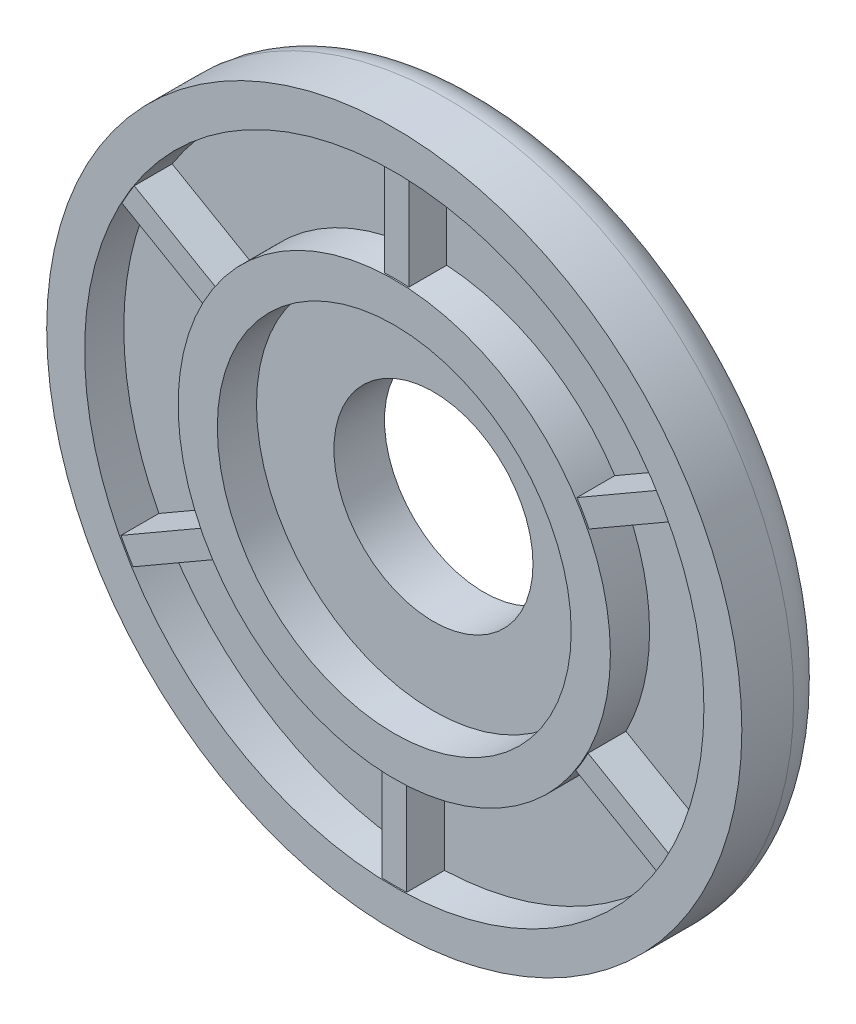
ISO-10303-21;
HEADER;
FILE_DESCRIPTION(('STEP AP214'),'2;1');
FILE_NAME('part.step','',(''),(''),'','','');
FILE_SCHEMA(('AUTOMOTIVE_DESIGN { 1 0 10303 214 1 1 1 1 }'));
ENDSEC;
DATA;
#1=APPLICATION_CONTEXT('core data for automotive mechanical design processes');
#2=APPLICATION_PROTOCOL_DEFINITION('international standard','automotive_design',2000,#1);
#3=PRODUCT_CONTEXT('',#1,'mechanical');
#4=PRODUCT('Part','Part','',(#3));
#5=PRODUCT_RELATED_PRODUCT_CATEGORY('part','',(#4));
#6=PRODUCT_DEFINITION_FORMATION('','',#4);
#7=PRODUCT_DEFINITION_CONTEXT('part definition',#1,'design');
#8=PRODUCT_DEFINITION('design','',#6,#7);
#9=PRODUCT_DEFINITION_SHAPE('','',#8);
#10=(LENGTH_UNIT() NAMED_UNIT(*) SI_UNIT(.MILLI.,.METRE.));
#11=(NAMED_UNIT(*) PLANE_ANGLE_UNIT() SI_UNIT($,.RADIAN.));
#12=(NAMED_UNIT(*) SI_UNIT($,.STERADIAN.) SOLID_ANGLE_UNIT());
#13=UNCERTAINTY_MEASURE_WITH_UNIT(LENGTH_MEASURE(1.E-05),#10,'distance_accuracy_value','');
#14=(GEOMETRIC_REPRESENTATION_CONTEXT(3) GLOBAL_UNCERTAINTY_ASSIGNED_CONTEXT((#13)) GLOBAL_UNIT_ASSIGNED_CONTEXT((#10,
#11,#12)) REPRESENTATION_CONTEXT('',''));
#15=CARTESIAN_POINT('',(0.,0.,0.));
#16=DIRECTION('',(0.,0.,1.));
#17=DIRECTION('',(1.,0.,0.));
#18=AXIS2_PLACEMENT_3D('',#15,#16,#17);
#19=CARTESIAN_POINT('',(0.,0.,4.));
#20=DIRECTION('',(0.,0.,1.));
#21=DIRECTION('',(1.,0.,0.));
#22=AXIS2_PLACEMENT_3D('',#19,#20,#21);
#23=PLANE('',#22);
#24=CARTESIAN_POINT('',(0.,0.,4.));
#25=DIRECTION('',(0.,0.,1.));
#26=DIRECTION('',(1.,0.,0.));
#27=AXIS2_PLACEMENT_3D('',#24,#25,#26);
#28=CIRCLE('',#27,17.1);
#29=CARTESIAN_POINT('',(-15.2287475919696,7.77786903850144,4.));
#30=VERTEX_POINT('',#29);
#31=CARTESIAN_POINT('',(-15.3067415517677,-7.62323179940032,4.));
#32=VERTEX_POINT('',#31);
#33=EDGE_CURVE('E436',#30,#32,#28,.T.);
#34=ORIENTED_EDGE('',*,*,#33,.F.);
#35=DIRECTION('',(0.866025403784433,-0.50000000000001,0.));
#36=VECTOR('',#35,1.);
#37=CARTESIAN_POINT('',(-22.0298769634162,11.7045029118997,4.));
#38=LINE('',#37,#36);
#39=CARTESIAN_POINT('',(-21.6432474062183,11.4812822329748,4.));
#40=VERTEX_POINT('',#39);
#41=EDGE_CURVE('E258',#40,#30,#38,.T.);
#42=ORIENTED_EDGE('',*,*,#41,.F.);
#43=CARTESIAN_POINT('',(0.,0.,4.));
#44=DIRECTION('',(0.,0.,1.));
#45=DIRECTION('',(1.,0.,0.));
#46=AXIS2_PLACEMENT_3D('',#43,#44,#45);
#47=CIRCLE('',#46,24.5);
#48=CARTESIAN_POINT('',(-21.7238028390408,-11.3281238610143,4.));
#49=VERTEX_POINT('',#48);
#50=EDGE_CURVE('E432',#40,#49,#47,.T.);
#51=ORIENTED_EDGE('',*,*,#50,.T.);
#52=DIRECTION('',(-0.866025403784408,-0.500000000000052,0.));
#53=VECTOR('',#52,1.);
#54=CARTESIAN_POINT('',(-14.9497706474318,-7.41713455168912,4.));
#55=LINE('',#54,#53);
#56=EDGE_CURVE('E268',#32,#49,#55,.T.);
#57=ORIENTED_EDGE('',*,*,#56,.F.);
#58=EDGE_LOOP('',(#34,#42,#51,#57));
#59=FACE_BOUND('',#58,.T.);
#60=ADVANCED_FACE('F63',(#59),#23,.T.);
#61=CARTESIAN_POINT('',(-0.878541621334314,24.4842431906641,4.));
#62=VERTEX_POINT('',#61);
#63=CARTESIAN_POINT('',(-20.6723444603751,13.1493031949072,4.));
#64=VERTEX_POINT('',#63);
#65=EDGE_CURVE('E428',#62,#64,#47,.T.);
#66=ORIENTED_EDGE('',*,*,#65,.T.);
#67=DIRECTION('',(-0.866025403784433,0.50000000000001,0.));
#68=VECTOR('',#67,1.);
#69=CARTESIAN_POINT('',(-13.898312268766,9.23831388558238,4.));
#70=LINE('',#69,#68);
#71=CARTESIAN_POINT('',(-14.2552831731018,9.44441113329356,4.));
#72=VERTEX_POINT('',#71);
#73=EDGE_CURVE('E255',#72,#64,#70,.T.);
#74=ORIENTED_EDGE('',*,*,#73,.F.);
#75=CARTESIAN_POINT('',(-0.878541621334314,17.0774168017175,4.));
#76=VERTEX_POINT('',#75);
#77=EDGE_CURVE('E230',#76,#72,#28,.T.);
#78=ORIENTED_EDGE('',*,*,#77,.F.);
#79=DIRECTION('',(0.,-1.,0.));
#80=VECTOR('',#79,1.);
#81=CARTESIAN_POINT('',(-0.878541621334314,24.9306845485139,4.));
#82=LINE('',#81,#80);
#83=EDGE_CURVE('E375',#62,#76,#82,.T.);
#84=ORIENTED_EDGE('',*,*,#83,.F.);
#85=EDGE_LOOP('',(#66,#74,#78,#84));
#86=FACE_BOUND('',#85,.T.);
#87=ADVANCED_FACE('F504',(#86),#23,.T.);
#88=CARTESIAN_POINT('',(0.,0.,0.9));
#89=DIRECTION('',(0.,0.,1.));
#90=DIRECTION('',(1.,0.,0.));
#91=AXIS2_PLACEMENT_3D('',#88,#89,#90);
#92=CYLINDRICAL_SURFACE('',#91,24.5);
#93=CARTESIAN_POINT('',(0.,0.,7.1));
#94=DIRECTION('',(0.,0.,1.));
#95=DIRECTION('',(1.,0.,0.));
#96=AXIS2_PLACEMENT_3D('',#93,#94,#95);
#97=CIRCLE('',#96,24.5);
#98=CARTESIAN_POINT('',(24.5,0.,7.1));
#99=VERTEX_POINT('',#98);
#100=EDGE_CURVE('E410',#99,#99,#97,.T.);
#101=ORIENTED_EDGE('',*,*,#100,.T.);
#102=EDGE_LOOP('',(#101));
#103=FACE_BOUND('',#102,.T.);
#104=DIRECTION('',(0.,0.,1.));
#105=VECTOR('',#104,1.);
#106=CARTESIAN_POINT('',(-21.6432474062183,11.4812822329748,0.9));
#107=LINE('',#106,#105);
#108=CARTESIAN_POINT('',(-21.6432474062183,11.4812822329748,7.));
#109=VERTEX_POINT('',#108);
#110=EDGE_CURVE('E84',#109,#40,#107,.F.);
#111=ORIENTED_EDGE('',*,*,#110,.F.);
#112=CARTESIAN_POINT('',(0.,0.,7.));
#113=DIRECTION('',(0.,0.,1.));
#114=DIRECTION('',(1.,0.,0.));
#115=AXIS2_PLACEMENT_3D('',#112,#113,#114);
#116=CIRCLE('',#115,24.5);
#117=CARTESIAN_POINT('',(-20.6723444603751,13.1493031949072,7.));
#118=VERTEX_POINT('',#117);
#119=EDGE_CURVE('E79',#109,#118,#116,.F.);
#120=ORIENTED_EDGE('',*,*,#119,.T.);
#121=DIRECTION('',(0.,0.,1.));
#122=VECTOR('',#121,1.);
#123=CARTESIAN_POINT('',(-20.6723444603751,13.1493031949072,0.9));
#124=LINE('',#123,#122);
#125=EDGE_CURVE('E248',#64,#118,#124,.T.);
#126=ORIENTED_EDGE('',*,*,#125,.F.);
#127=ORIENTED_EDGE('',*,*,#65,.F.);
#128=DIRECTION('',(0.,0.,1.));
#129=VECTOR('',#128,1.);
#130=CARTESIAN_POINT('',(-0.878541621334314,24.4842431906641,0.9));
#131=LINE('',#130,#129);
#132=CARTESIAN_POINT('',(-0.878541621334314,24.4842431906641,7.));
#133=VERTEX_POINT('',#132);
#134=EDGE_CURVE('E398',#133,#62,#131,.F.);
#135=ORIENTED_EDGE('',*,*,#134,.F.);
#136=CARTESIAN_POINT('',(0.,0.,7.));
#137=DIRECTION('',(0.,0.,1.));
#138=DIRECTION('',(1.,0.,0.));
#139=AXIS2_PLACEMENT_3D('',#136,#137,#138);
#140=CIRCLE('',#139,24.5);
#141=CARTESIAN_POINT('',(1.05145837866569,24.477427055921,7.));
#142=VERTEX_POINT('',#141);
#143=EDGE_CURVE('E385',#133,#142,#140,.F.);
#144=ORIENTED_EDGE('',*,*,#143,.T.);
#145=DIRECTION('',(0.,0.,1.));
#146=VECTOR('',#145,1.);
#147=CARTESIAN_POINT('',(1.05145837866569,24.477427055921,0.9));
#148=LINE('',#147,#146);
#149=CARTESIAN_POINT('',(1.05145837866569,24.477427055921,4.));
#150=VERTEX_POINT('',#149);
#151=EDGE_CURVE('E394',#150,#142,#148,.T.);
#152=ORIENTED_EDGE('',*,*,#151,.F.);
#153=CARTESIAN_POINT('',(20.7647057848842,13.0029609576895,4.));
#154=VERTEX_POINT('',#153);
#155=EDGE_CURVE('E418',#154,#150,#47,.T.);
#156=ORIENTED_EDGE('',*,*,#155,.F.);
#157=DIRECTION('',(0.,0.,1.));
#158=VECTOR('',#157,1.);
#159=CARTESIAN_POINT('',(20.7647057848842,13.0029609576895,0.9));
#160=LINE('',#159,#158);
#161=CARTESIAN_POINT('',(20.7647057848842,13.0029609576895,7.));
#162=VERTEX_POINT('',#161);
#163=EDGE_CURVE('E371',#162,#154,#160,.F.);
#164=ORIENTED_EDGE('',*,*,#163,.F.);
#165=CARTESIAN_POINT('',(0.,0.,7.));
#166=DIRECTION('',(0.,0.,1.));
#167=DIRECTION('',(1.,0.,0.));
#168=AXIS2_PLACEMENT_3D('',#165,#166,#167);
#169=CIRCLE('',#168,24.5);
#170=CARTESIAN_POINT('',(21.723802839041,11.328123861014,7.));
#171=VERTEX_POINT('',#170);
#172=EDGE_CURVE('E358',#162,#171,#169,.F.);
#173=ORIENTED_EDGE('',*,*,#172,.T.);
#174=DIRECTION('',(0.,0.,1.));
#175=VECTOR('',#174,1.);
#176=CARTESIAN_POINT('',(21.723802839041,11.328123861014,0.9));
#177=LINE('',#176,#175);
#178=CARTESIAN_POINT('',(21.723802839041,11.328123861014,4.));
#179=VERTEX_POINT('',#178);
#180=EDGE_CURVE('E367',#179,#171,#177,.T.);
#181=ORIENTED_EDGE('',*,*,#180,.F.);
#182=CARTESIAN_POINT('',(21.6432474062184,-11.4812822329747,4.));
#183=VERTEX_POINT('',#182);
#184=EDGE_CURVE('E548',#183,#179,#47,.T.);
#185=ORIENTED_EDGE('',*,*,#184,.F.);
#186=DIRECTION('',(0.,0.,1.));
#187=VECTOR('',#186,1.);
#188=CARTESIAN_POINT('',(21.6432474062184,-11.4812822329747,0.9));
#189=LINE('',#188,#187);
#190=CARTESIAN_POINT('',(21.6432474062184,-11.4812822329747,7.));
#191=VERTEX_POINT('',#190);
#192=EDGE_CURVE('E344',#191,#183,#189,.F.);
#193=ORIENTED_EDGE('',*,*,#192,.F.);
#194=CARTESIAN_POINT('',(0.,0.,7.));
#195=DIRECTION('',(0.,0.,1.));
#196=DIRECTION('',(1.,0.,0.));
#197=AXIS2_PLACEMENT_3D('',#194,#195,#196);
#198=CIRCLE('',#197,24.5);
#199=CARTESIAN_POINT('',(20.6723444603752,-13.1493031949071,7.));
#200=VERTEX_POINT('',#199);
#201=EDGE_CURVE('E331',#191,#200,#198,.F.);
#202=ORIENTED_EDGE('',*,*,#201,.T.);
#203=DIRECTION('',(0.,0.,1.));
#204=VECTOR('',#203,1.);
#205=CARTESIAN_POINT('',(20.6723444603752,-13.1493031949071,0.9));
#206=LINE('',#205,#204);
#207=CARTESIAN_POINT('',(20.6723444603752,-13.1493031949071,4.));
#208=VERTEX_POINT('',#207);
#209=EDGE_CURVE('E340',#208,#200,#206,.T.);
#210=ORIENTED_EDGE('',*,*,#209,.F.);
#211=CARTESIAN_POINT('',(0.878541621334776,-24.4842431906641,4.));
#212=VERTEX_POINT('',#211);
#213=EDGE_CURVE('E551',#212,#208,#47,.T.);
#214=ORIENTED_EDGE('',*,*,#213,.F.);
#215=DIRECTION('',(0.,0.,1.));
#216=VECTOR('',#215,1.);
#217=CARTESIAN_POINT('',(0.878541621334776,-24.4842431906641,0.9));
#218=LINE('',#217,#216);
#219=CARTESIAN_POINT('',(0.878541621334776,-24.4842431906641,7.));
#220=VERTEX_POINT('',#219);
#221=EDGE_CURVE('E317',#220,#212,#218,.F.);
#222=ORIENTED_EDGE('',*,*,#221,.F.);
#223=CARTESIAN_POINT('',(0.,0.,7.));
#224=DIRECTION('',(0.,0.,1.));
#225=DIRECTION('',(1.,0.,0.));
#226=AXIS2_PLACEMENT_3D('',#223,#224,#225);
#227=CIRCLE('',#226,24.5);
#228=CARTESIAN_POINT('',(-1.05145837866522,-24.477427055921,7.));
#229=VERTEX_POINT('',#228);
#230=EDGE_CURVE('E304',#220,#229,#227,.F.);
#231=ORIENTED_EDGE('',*,*,#230,.T.);
#232=DIRECTION('',(0.,0.,1.));
#233=VECTOR('',#232,1.);
#234=CARTESIAN_POINT('',(-1.05145837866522,-24.477427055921,0.9));
#235=LINE('',#234,#233);
#236=CARTESIAN_POINT('',(-1.05145837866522,-24.477427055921,4.));
#237=VERTEX_POINT('',#236);
#238=EDGE_CURVE('E313',#237,#229,#235,.T.);
#239=ORIENTED_EDGE('',*,*,#238,.F.);
#240=CARTESIAN_POINT('',(-20.764705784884,-13.0029609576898,4.));
#241=VERTEX_POINT('',#240);
#242=EDGE_CURVE('E569',#241,#237,#47,.T.);
#243=ORIENTED_EDGE('',*,*,#242,.F.);
#244=DIRECTION('',(0.,0.,1.));
#245=VECTOR('',#244,1.);
#246=CARTESIAN_POINT('',(-20.764705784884,-13.0029609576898,0.9));
#247=LINE('',#246,#245);
#248=CARTESIAN_POINT('',(-20.764705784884,-13.0029609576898,7.));
#249=VERTEX_POINT('',#248);
#250=EDGE_CURVE('E290',#249,#241,#247,.F.);
#251=ORIENTED_EDGE('',*,*,#250,.F.);
#252=CARTESIAN_POINT('',(0.,0.,7.));
#253=DIRECTION('',(0.,0.,1.));
#254=DIRECTION('',(1.,0.,0.));
#255=AXIS2_PLACEMENT_3D('',#252,#253,#254);
#256=CIRCLE('',#255,24.5);
#257=CARTESIAN_POINT('',(-21.7238028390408,-11.3281238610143,7.));
#258=VERTEX_POINT('',#257);
#259=EDGE_CURVE('E277',#249,#258,#256,.F.);
#260=ORIENTED_EDGE('',*,*,#259,.T.);
#261=DIRECTION('',(0.,0.,1.));
#262=VECTOR('',#261,1.);
#263=CARTESIAN_POINT('',(-21.7238028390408,-11.3281238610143,0.9));
#264=LINE('',#263,#262);
#265=EDGE_CURVE('E286',#49,#258,#264,.T.);
#266=ORIENTED_EDGE('',*,*,#265,.F.);
#267=ORIENTED_EDGE('',*,*,#50,.F.);
#268=EDGE_LOOP('',(#111,#120,#126,#127,#135,#144,#152,#156,#164,#173,#181,#185,#193,#202,#210,
#214,#222,#231,#239,#243,#251,#260,#266,#267));
#269=FACE_BOUND('',#268,.T.);
#270=ADVANCED_FACE('F510',(#103,#269),#92,.F.);
#271=CARTESIAN_POINT('',(0.,0.,0.9));
#272=DIRECTION('',(0.,0.,1.));
#273=DIRECTION('',(1.,0.,0.));
#274=AXIS2_PLACEMENT_3D('',#271,#272,#273);
#275=CYLINDRICAL_SURFACE('',#274,17.1);
#276=CARTESIAN_POINT('',(0.,0.,7.1));
#277=DIRECTION('',(0.,0.,1.));
#278=DIRECTION('',(1.,0.,0.));
#279=AXIS2_PLACEMENT_3D('',#276,#277,#278);
#280=CIRCLE('',#279,17.1);
#281=CARTESIAN_POINT('',(17.1,0.,7.1));
#282=VERTEX_POINT('',#281);
#283=EDGE_CURVE('E405',#282,#282,#280,.T.);
#284=ORIENTED_EDGE('',*,*,#283,.F.);
#285=EDGE_LOOP('',(#284));
#286=FACE_BOUND('',#285,.T.);
#287=CARTESIAN_POINT('',(0.,0.,7.));
#288=DIRECTION('',(0.,0.,1.));
#289=DIRECTION('',(1.,0.,0.));
#290=AXIS2_PLACEMENT_3D('',#287,#288,#289);
#291=CIRCLE('',#290,17.1);
#292=CARTESIAN_POINT('',(-15.2287475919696,7.77786903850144,7.));
#293=VERTEX_POINT('',#292);
#294=CARTESIAN_POINT('',(-14.2552831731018,9.44441113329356,7.));
#295=VERTEX_POINT('',#294);
#296=EDGE_CURVE('E227',#293,#295,#291,.F.);
#297=ORIENTED_EDGE('',*,*,#296,.F.);
#298=DIRECTION('',(0.,0.,1.));
#299=VECTOR('',#298,1.);
#300=CARTESIAN_POINT('',(-15.2287475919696,7.77786903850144,0.9));
#301=LINE('',#300,#299);
#302=EDGE_CURVE('E235',#293,#30,#301,.F.);
#303=ORIENTED_EDGE('',*,*,#302,.T.);
#304=ORIENTED_EDGE('',*,*,#33,.T.);
#305=DIRECTION('',(0.,0.,1.));
#306=VECTOR('',#305,1.);
#307=CARTESIAN_POINT('',(-15.3067415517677,-7.62323179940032,0.9));
#308=LINE('',#307,#306);
#309=CARTESIAN_POINT('',(-15.3067415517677,-7.62323179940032,7.));
#310=VERTEX_POINT('',#309);
#311=EDGE_CURVE('E483',#32,#310,#308,.T.);
#312=ORIENTED_EDGE('',*,*,#311,.T.);
#313=CARTESIAN_POINT('',(0.,0.,7.));
#314=DIRECTION('',(0.,0.,1.));
#315=DIRECTION('',(1.,0.,0.));
#316=AXIS2_PLACEMENT_3D('',#313,#314,#315);
#317=CIRCLE('',#316,17.1);
#318=CARTESIAN_POINT('',(-14.3502059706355,-9.29954776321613,7.));
#319=VERTEX_POINT('',#318);
#320=EDGE_CURVE('E479',#319,#310,#317,.F.);
#321=ORIENTED_EDGE('',*,*,#320,.F.);
#322=DIRECTION('',(0.,0.,1.));
#323=VECTOR('',#322,1.);
#324=CARTESIAN_POINT('',(-14.3502059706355,-9.29954776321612,0.9));
#325=LINE('',#324,#323);
#326=CARTESIAN_POINT('',(-14.3502059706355,-9.29954776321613,4.));
#327=VERTEX_POINT('',#326);
#328=EDGE_CURVE('E245',#319,#327,#325,.F.);
#329=ORIENTED_EDGE('',*,*,#328,.T.);
#330=CARTESIAN_POINT('',(-1.05145837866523,-17.0676429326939,4.));
#331=VERTEX_POINT('',#330);
#332=EDGE_CURVE('E595',#327,#331,#28,.T.);
#333=ORIENTED_EDGE('',*,*,#332,.T.);
#334=DIRECTION('',(0.,0.,1.));
#335=VECTOR('',#334,1.);
#336=CARTESIAN_POINT('',(-1.05145837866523,-17.0676429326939,0.9));
#337=LINE('',#336,#335);
#338=CARTESIAN_POINT('',(-1.05145837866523,-17.0676429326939,7.));
#339=VERTEX_POINT('',#338);
#340=EDGE_CURVE('E473',#331,#339,#337,.T.);
#341=ORIENTED_EDGE('',*,*,#340,.T.);
#342=CARTESIAN_POINT('',(0.,0.,7.));
#343=DIRECTION('',(0.,0.,1.));
#344=DIRECTION('',(1.,0.,0.));
#345=AXIS2_PLACEMENT_3D('',#342,#343,#344);
#346=CIRCLE('',#345,17.1);
#347=CARTESIAN_POINT('',(0.878541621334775,-17.0774168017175,7.));
#348=VERTEX_POINT('',#347);
#349=EDGE_CURVE('E469',#348,#339,#346,.F.);
#350=ORIENTED_EDGE('',*,*,#349,.F.);
#351=DIRECTION('',(0.,0.,1.));
#352=VECTOR('',#351,1.);
#353=CARTESIAN_POINT('',(0.878541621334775,-17.0774168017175,0.9));
#354=LINE('',#353,#352);
#355=CARTESIAN_POINT('',(0.878541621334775,-17.0774168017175,4.));
#356=VERTEX_POINT('',#355);
#357=EDGE_CURVE('E476',#348,#356,#354,.F.);
#358=ORIENTED_EDGE('',*,*,#357,.T.);
#359=CARTESIAN_POINT('',(14.2552831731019,-9.44441113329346,4.));
#360=VERTEX_POINT('',#359);
#361=EDGE_CURVE('E567',#356,#360,#28,.T.);
#362=ORIENTED_EDGE('',*,*,#361,.T.);
#363=DIRECTION('',(0.,0.,1.));
#364=VECTOR('',#363,1.);
#365=CARTESIAN_POINT('',(14.2552831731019,-9.44441113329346,0.9));
#366=LINE('',#365,#364);
#367=CARTESIAN_POINT('',(14.2552831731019,-9.44441113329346,7.));
#368=VERTEX_POINT('',#367);
#369=EDGE_CURVE('E463',#360,#368,#366,.T.);
#370=ORIENTED_EDGE('',*,*,#369,.T.);
#371=CARTESIAN_POINT('',(0.,0.,7.));
#372=DIRECTION('',(0.,0.,1.));
#373=DIRECTION('',(1.,0.,0.));
#374=AXIS2_PLACEMENT_3D('',#371,#372,#373);
#375=CIRCLE('',#374,17.1);
#376=CARTESIAN_POINT('',(15.2287475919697,-7.77786903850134,7.));
#377=VERTEX_POINT('',#376);
#378=EDGE_CURVE('E459',#377,#368,#375,.F.);
#379=ORIENTED_EDGE('',*,*,#378,.F.);
#380=DIRECTION('',(0.,0.,1.));
#381=VECTOR('',#380,1.);
#382=CARTESIAN_POINT('',(15.2287475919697,-7.77786903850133,0.9));
#383=LINE('',#382,#381);
#384=CARTESIAN_POINT('',(15.2287475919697,-7.77786903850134,4.));
#385=VERTEX_POINT('',#384);
#386=EDGE_CURVE('E466',#377,#385,#383,.F.);
#387=ORIENTED_EDGE('',*,*,#386,.T.);
#388=CARTESIAN_POINT('',(15.3067415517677,7.6232317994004,4.));
#389=VERTEX_POINT('',#388);
#390=EDGE_CURVE('E532',#385,#389,#28,.T.);
#391=ORIENTED_EDGE('',*,*,#390,.T.);
#392=DIRECTION('',(0.,0.,1.));
#393=VECTOR('',#392,1.);
#394=CARTESIAN_POINT('',(15.3067415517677,7.6232317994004,0.9));
#395=LINE('',#394,#393);
#396=CARTESIAN_POINT('',(15.3067415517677,7.6232317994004,7.));
#397=VERTEX_POINT('',#396);
#398=EDGE_CURVE('E453',#389,#397,#395,.T.);
#399=ORIENTED_EDGE('',*,*,#398,.T.);
#400=CARTESIAN_POINT('',(0.,0.,7.));
#401=DIRECTION('',(0.,0.,1.));
#402=DIRECTION('',(1.,0.,0.));
#403=AXIS2_PLACEMENT_3D('',#400,#401,#402);
#404=CIRCLE('',#403,17.1);
#405=CARTESIAN_POINT('',(14.3502059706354,9.2995477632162,7.));
#406=VERTEX_POINT('',#405);
#407=EDGE_CURVE('E449',#406,#397,#404,.F.);
#408=ORIENTED_EDGE('',*,*,#407,.F.);
#409=DIRECTION('',(0.,0.,1.));
#410=VECTOR('',#409,1.);
#411=CARTESIAN_POINT('',(14.3502059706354,9.2995477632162,0.9));
#412=LINE('',#411,#410);
#413=CARTESIAN_POINT('',(14.3502059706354,9.2995477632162,4.));
#414=VERTEX_POINT('',#413);
#415=EDGE_CURVE('E456',#406,#414,#412,.F.);
#416=ORIENTED_EDGE('',*,*,#415,.T.);
#417=CARTESIAN_POINT('',(1.05145837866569,17.0676429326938,4.));
#418=VERTEX_POINT('',#417);
#419=EDGE_CURVE('E423',#414,#418,#28,.T.);
#420=ORIENTED_EDGE('',*,*,#419,.T.);
#421=DIRECTION('',(0.,0.,1.));
#422=VECTOR('',#421,1.);
#423=CARTESIAN_POINT('',(1.05145837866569,17.0676429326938,0.9));
#424=LINE('',#423,#422);
#425=CARTESIAN_POINT('',(1.05145837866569,17.0676429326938,7.));
#426=VERTEX_POINT('',#425);
#427=EDGE_CURVE('E443',#418,#426,#424,.T.);
#428=ORIENTED_EDGE('',*,*,#427,.T.);
#429=CARTESIAN_POINT('',(0.,0.,7.));
#430=DIRECTION('',(0.,0.,1.));
#431=DIRECTION('',(1.,0.,0.));
#432=AXIS2_PLACEMENT_3D('',#429,#430,#431);
#433=CIRCLE('',#432,17.1);
#434=CARTESIAN_POINT('',(-0.878541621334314,17.0774168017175,7.));
#435=VERTEX_POINT('',#434);
#436=EDGE_CURVE('E435',#435,#426,#433,.F.);
#437=ORIENTED_EDGE('',*,*,#436,.F.);
#438=DIRECTION('',(0.,0.,1.));
#439=VECTOR('',#438,1.);
#440=CARTESIAN_POINT('',(-0.878541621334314,17.0774168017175,0.9));
#441=LINE('',#440,#439);
#442=EDGE_CURVE('E446',#435,#76,#441,.F.);
#443=ORIENTED_EDGE('',*,*,#442,.T.);
#444=ORIENTED_EDGE('',*,*,#77,.T.);
#445=DIRECTION('',(0.,0.,1.));
#446=VECTOR('',#445,1.);
#447=CARTESIAN_POINT('',(-14.2552831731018,9.44441113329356,0.9));
#448=LINE('',#447,#446);
#449=EDGE_CURVE('E224',#72,#295,#448,.T.);
#450=ORIENTED_EDGE('',*,*,#449,.T.);
#451=EDGE_LOOP('',(#297,#303,#304,#312,#321,#329,#333,#341,#350,#358,#362,#370,#379,#387,#391,
#399,#408,#416,#420,#428,#437,#443,#444,#450));
#452=FACE_BOUND('',#451,.T.);
#453=ADVANCED_FACE('F226',(#286,#452),#275,.T.);
#454=ORIENTED_EDGE('',*,*,#332,.F.);
#455=DIRECTION('',(0.866025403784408,0.500000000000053,0.));
#456=VECTOR('',#455,1.);
#457=CARTESIAN_POINT('',(-21.1513353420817,-13.2261816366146,4.));
#458=LINE('',#457,#456);
#459=EDGE_CURVE('E272',#241,#327,#458,.T.);
#460=ORIENTED_EDGE('',*,*,#459,.F.);
#461=ORIENTED_EDGE('',*,*,#242,.T.);
#462=DIRECTION('',(0.,-1.,0.));
#463=VECTOR('',#462,1.);
#464=CARTESIAN_POINT('',(-1.05145837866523,-16.6554484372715,4.));
#465=LINE('',#464,#463);
#466=EDGE_CURVE('E295',#331,#237,#465,.T.);
#467=ORIENTED_EDGE('',*,*,#466,.F.);
#468=EDGE_LOOP('',(#454,#460,#461,#467));
#469=FACE_BOUND('',#468,.T.);
#470=ADVANCED_FACE('F512',(#469),#23,.T.);
#471=ORIENTED_EDGE('',*,*,#361,.F.);
#472=DIRECTION('',(0.,1.,0.));
#473=VECTOR('',#472,1.);
#474=CARTESIAN_POINT('',(0.878541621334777,-24.9306845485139,4.));
#475=LINE('',#474,#473);
#476=EDGE_CURVE('E299',#212,#356,#475,.T.);
#477=ORIENTED_EDGE('',*,*,#476,.F.);
#478=ORIENTED_EDGE('',*,*,#213,.T.);
#479=DIRECTION('',(0.866025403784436,-0.500000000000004,0.));
#480=VECTOR('',#479,1.);
#481=CARTESIAN_POINT('',(13.8983122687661,-9.23831388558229,4.));
#482=LINE('',#481,#480);
#483=EDGE_CURVE('E322',#360,#208,#482,.T.);
#484=ORIENTED_EDGE('',*,*,#483,.F.);
#485=EDGE_LOOP('',(#471,#477,#478,#484));
#486=FACE_BOUND('',#485,.T.);
#487=ADVANCED_FACE('F525',(#486),#23,.T.);
#488=ORIENTED_EDGE('',*,*,#390,.F.);
#489=DIRECTION('',(-0.866025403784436,0.500000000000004,0.));
#490=VECTOR('',#489,1.);
#491=CARTESIAN_POINT('',(22.0298769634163,-11.7045029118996,4.));
#492=LINE('',#491,#490);
#493=EDGE_CURVE('E326',#183,#385,#492,.T.);
#494=ORIENTED_EDGE('',*,*,#493,.F.);
#495=ORIENTED_EDGE('',*,*,#184,.T.);
#496=DIRECTION('',(0.86602540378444,0.499999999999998,0.));
#497=VECTOR('',#496,1.);
#498=CARTESIAN_POINT('',(14.9497706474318,7.41713455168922,4.));
#499=LINE('',#498,#497);
#500=EDGE_CURVE('E349',#389,#179,#499,.T.);
#501=ORIENTED_EDGE('',*,*,#500,.F.);
#502=EDGE_LOOP('',(#488,#494,#495,#501));
#503=FACE_BOUND('',#502,.T.);
#504=ADVANCED_FACE('F518',(#503),#23,.T.);
#505=ORIENTED_EDGE('',*,*,#419,.F.);
#506=DIRECTION('',(-0.86602540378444,-0.499999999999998,0.));
#507=VECTOR('',#506,1.);
#508=CARTESIAN_POINT('',(21.1513353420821,13.2261816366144,4.));
#509=LINE('',#508,#507);
#510=EDGE_CURVE('E353',#154,#414,#509,.T.);
#511=ORIENTED_EDGE('',*,*,#510,.F.);
#512=ORIENTED_EDGE('',*,*,#155,.T.);
#513=DIRECTION('',(0.,1.,0.));
#514=VECTOR('',#513,1.);
#515=CARTESIAN_POINT('',(1.05145837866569,16.6554484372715,4.));
#516=LINE('',#515,#514);
#517=EDGE_CURVE('E381',#418,#150,#516,.T.);
#518=ORIENTED_EDGE('',*,*,#517,.F.);
#519=EDGE_LOOP('',(#505,#511,#512,#518));
#520=FACE_BOUND('',#519,.T.);
#521=ADVANCED_FACE('F507',(#520),#23,.T.);
#522=CARTESIAN_POINT('',(0.,0.,4.));
#523=DIRECTION('',(0.,0.,1.));
#524=DIRECTION('',(1.,0.,0.));
#525=AXIS2_PLACEMENT_3D('',#522,#523,#524);
#526=CIRCLE('',#525,7.875);
#527=CARTESIAN_POINT('',(7.875,0.,4.));
#528=VERTEX_POINT('',#527);
#529=EDGE_CURVE('E419',#528,#528,#526,.T.);
#530=ORIENTED_EDGE('',*,*,#529,.F.);
#531=EDGE_LOOP('',(#530));
#532=FACE_BOUND('',#531,.T.);
#533=CARTESIAN_POINT('',(0.,0.,4.));
#534=DIRECTION('',(0.,0.,1.));
#535=DIRECTION('',(1.,0.,0.));
#536=AXIS2_PLACEMENT_3D('',#533,#534,#535);
#537=CIRCLE('',#536,14.);
#538=CARTESIAN_POINT('',(14.,0.,4.));
#539=VERTEX_POINT('',#538);
#540=EDGE_CURVE('E409',#539,#539,#537,.T.);
#541=ORIENTED_EDGE('',*,*,#540,.T.);
#542=EDGE_LOOP('',(#541));
#543=FACE_BOUND('',#542,.T.);
#544=ADVANCED_FACE('F517',(#532,#543),#23,.T.);
#545=CARTESIAN_POINT('',(0.,0.,0.));
#546=DIRECTION('',(0.,0.,1.));
#547=DIRECTION('',(1.,0.,0.));
#548=AXIS2_PLACEMENT_3D('',#545,#546,#547);
#549=PLANE('',#548);
#550=CARTESIAN_POINT('',(0.,0.,0.));
#551=DIRECTION('',(0.,0.,1.));
#552=DIRECTION('',(1.,0.,0.));
#553=AXIS2_PLACEMENT_3D('',#550,#551,#552);
#554=CIRCLE('',#553,24.5);
#555=CARTESIAN_POINT('',(24.5,0.,0.));
#556=VERTEX_POINT('',#555);
#557=EDGE_CURVE('E12',#556,#556,#554,.F.);
#558=ORIENTED_EDGE('',*,*,#557,.T.);
#559=EDGE_LOOP('',(#558));
#560=FACE_BOUND('',#559,.T.);
#561=CARTESIAN_POINT('',(0.,0.,0.));
#562=DIRECTION('',(0.,0.,1.));
#563=DIRECTION('',(1.,0.,0.));
#564=AXIS2_PLACEMENT_3D('',#561,#562,#563);
#565=CIRCLE('',#564,7.875);
#566=CARTESIAN_POINT('',(7.875,0.,0.));
#567=VERTEX_POINT('',#566);
#568=EDGE_CURVE('E424',#567,#567,#565,.T.);
#569=ORIENTED_EDGE('',*,*,#568,.T.);
#570=EDGE_LOOP('',(#569));
#571=FACE_BOUND('',#570,.T.);
#572=ADVANCED_FACE('F523',(#560,#571),#549,.F.);
#573=CARTESIAN_POINT('',(0.,0.,4.));
#574=DIRECTION('',(0.,0.,-1.));
#575=DIRECTION('',(-1.,0.,0.));
#576=AXIS2_PLACEMENT_3D('',#573,#574,#575);
#577=CYLINDRICAL_SURFACE('',#576,27.5);
#578=CARTESIAN_POINT('',(0.,0.,3.));
#579=DIRECTION('',(0.,0.,1.));
#580=DIRECTION('',(1.,0.,0.));
#581=AXIS2_PLACEMENT_3D('',#578,#579,#580);
#582=CIRCLE('',#581,27.5);
#583=CARTESIAN_POINT('',(27.5,0.,3.));
#584=VERTEX_POINT('',#583);
#585=EDGE_CURVE('E72',#584,#584,#582,.T.);
#586=ORIENTED_EDGE('',*,*,#585,.T.);
#587=EDGE_LOOP('',(#586));
#588=FACE_BOUND('',#587,.T.);
#589=CARTESIAN_POINT('',(0.,0.,7.1));
#590=DIRECTION('',(0.,0.,1.));
#591=DIRECTION('',(1.,0.,0.));
#592=AXIS2_PLACEMENT_3D('',#589,#590,#591);
#593=CIRCLE('',#592,27.5);
#594=CARTESIAN_POINT('',(27.5,0.,7.1));
#595=VERTEX_POINT('',#594);
#596=EDGE_CURVE('E414',#595,#595,#593,.T.);
#597=ORIENTED_EDGE('',*,*,#596,.F.);
#598=EDGE_LOOP('',(#597));
#599=FACE_BOUND('',#598,.T.);
#600=ADVANCED_FACE('F494',(#588,#599),#577,.T.);
#601=CARTESIAN_POINT('',(0.,0.,4.));
#602=DIRECTION('',(0.,0.,-1.));
#603=DIRECTION('',(-1.,0.,0.));
#604=AXIS2_PLACEMENT_3D('',#601,#602,#603);
#605=CYLINDRICAL_SURFACE('',#604,7.875);
#606=ORIENTED_EDGE('',*,*,#529,.T.);
#607=EDGE_LOOP('',(#606));
#608=FACE_BOUND('',#607,.T.);
#609=ORIENTED_EDGE('',*,*,#568,.F.);
#610=EDGE_LOOP('',(#609));
#611=FACE_BOUND('',#610,.T.);
#612=ADVANCED_FACE('F711',(#608,#611),#605,.F.);
#613=CARTESIAN_POINT('',(0.,0.,7.1));
#614=DIRECTION('',(0.,0.,1.));
#615=DIRECTION('',(1.,0.,0.));
#616=AXIS2_PLACEMENT_3D('',#613,#614,#615);
#617=PLANE('',#616);
#618=ORIENTED_EDGE('',*,*,#100,.F.);
#619=EDGE_LOOP('',(#618));
#620=FACE_BOUND('',#619,.T.);
#621=ORIENTED_EDGE('',*,*,#596,.T.);
#622=EDGE_LOOP('',(#621));
#623=FACE_BOUND('',#622,.T.);
#624=ADVANCED_FACE('F707',(#620,#623),#617,.T.);
#625=CARTESIAN_POINT('',(0.,0.,0.9));
#626=DIRECTION('',(0.,0.,1.));
#627=DIRECTION('',(1.,0.,0.));
#628=AXIS2_PLACEMENT_3D('',#625,#626,#627);
#629=CYLINDRICAL_SURFACE('',#628,14.);
#630=CARTESIAN_POINT('',(0.,0.,7.1));
#631=DIRECTION('',(0.,0.,1.));
#632=DIRECTION('',(1.,0.,0.));
#633=AXIS2_PLACEMENT_3D('',#630,#631,#632);
#634=CIRCLE('',#633,14.);
#635=CARTESIAN_POINT('',(14.,0.,7.1));
#636=VERTEX_POINT('',#635);
#637=EDGE_CURVE('E402',#636,#636,#634,.T.);
#638=CARTESIAN_POINT('',(14.,0.,4.));
#639=CARTESIAN_POINT('',(14.,0.,4.03229166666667));
#640=CARTESIAN_POINT('',(14.,0.,4.06458333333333));
#641=CARTESIAN_POINT('',(14.,0.,4.12916666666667));
#642=CARTESIAN_POINT('',(14.,0.,4.16145833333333));
#643=CARTESIAN_POINT('',(14.,0.,4.22604166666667));
#644=CARTESIAN_POINT('',(14.,0.,4.25833333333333));
#645=CARTESIAN_POINT('',(14.,0.,4.32291666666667));
#646=CARTESIAN_POINT('',(14.,0.,4.35520833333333));
#647=CARTESIAN_POINT('',(14.,0.,4.41979166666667));
#648=CARTESIAN_POINT('',(14.,0.,4.45208333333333));
#649=CARTESIAN_POINT('',(14.,0.,4.51666666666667));
#650=CARTESIAN_POINT('',(14.,0.,4.54895833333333));
#651=CARTESIAN_POINT('',(14.,0.,4.61354166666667));
#652=CARTESIAN_POINT('',(14.,0.,4.64583333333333));
#653=CARTESIAN_POINT('',(14.,0.,4.71041666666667));
#654=CARTESIAN_POINT('',(14.,0.,4.74270833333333));
#655=CARTESIAN_POINT('',(14.,0.,4.80729166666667));
#656=CARTESIAN_POINT('',(14.,0.,4.83958333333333));
#657=CARTESIAN_POINT('',(14.,0.,4.90416666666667));
#658=CARTESIAN_POINT('',(14.,0.,4.93645833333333));
#659=CARTESIAN_POINT('',(14.,0.,5.00104166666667));
#660=CARTESIAN_POINT('',(14.,0.,5.03333333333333));
#661=CARTESIAN_POINT('',(14.,0.,5.09791666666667));
#662=CARTESIAN_POINT('',(14.,0.,5.13020833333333));
#663=CARTESIAN_POINT('',(14.,0.,5.19479166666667));
#664=CARTESIAN_POINT('',(14.,0.,5.22708333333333));
#665=CARTESIAN_POINT('',(14.,0.,5.29166666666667));
#666=CARTESIAN_POINT('',(14.,0.,5.32395833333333));
#667=CARTESIAN_POINT('',(14.,0.,5.38854166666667));
#668=CARTESIAN_POINT('',(14.,0.,5.42083333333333));
#669=CARTESIAN_POINT('',(14.,0.,5.48541666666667));
#670=CARTESIAN_POINT('',(14.,0.,5.51770833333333));
#671=CARTESIAN_POINT('',(14.,0.,5.58229166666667));
#672=CARTESIAN_POINT('',(14.,0.,5.61458333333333));
#673=CARTESIAN_POINT('',(14.,0.,5.67916666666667));
#674=CARTESIAN_POINT('',(14.,0.,5.71145833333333));
#675=CARTESIAN_POINT('',(14.,0.,5.77604166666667));
#676=CARTESIAN_POINT('',(14.,0.,5.80833333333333));
#677=CARTESIAN_POINT('',(14.,0.,5.87291666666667));
#678=CARTESIAN_POINT('',(14.,0.,5.90520833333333));
#679=CARTESIAN_POINT('',(14.,0.,5.96979166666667));
#680=CARTESIAN_POINT('',(14.,0.,6.00208333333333));
#681=CARTESIAN_POINT('',(14.,0.,6.06666666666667));
#682=CARTESIAN_POINT('',(14.,0.,6.09895833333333));
#683=CARTESIAN_POINT('',(14.,0.,6.16354166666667));
#684=CARTESIAN_POINT('',(14.,0.,6.19583333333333));
#685=CARTESIAN_POINT('',(14.,0.,6.26041666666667));
#686=CARTESIAN_POINT('',(14.,0.,6.29270833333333));
#687=CARTESIAN_POINT('',(14.,0.,6.35729166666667));
#688=CARTESIAN_POINT('',(14.,0.,6.38958333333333));
#689=CARTESIAN_POINT('',(14.,0.,6.45416666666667));
#690=CARTESIAN_POINT('',(14.,0.,6.48645833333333));
#691=CARTESIAN_POINT('',(14.,0.,6.55104166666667));
#692=CARTESIAN_POINT('',(14.,0.,6.58333333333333));
#693=CARTESIAN_POINT('',(14.,0.,6.64791666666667));
#694=CARTESIAN_POINT('',(14.,0.,6.68020833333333));
#695=CARTESIAN_POINT('',(14.,0.,6.74479166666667));
#696=CARTESIAN_POINT('',(14.,0.,6.77708333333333));
#697=CARTESIAN_POINT('',(14.,0.,6.84166666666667));
#698=CARTESIAN_POINT('',(14.,0.,6.87395833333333));
#699=CARTESIAN_POINT('',(14.,0.,6.93854166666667));
#700=CARTESIAN_POINT('',(14.,0.,6.97083333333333));
#701=CARTESIAN_POINT('',(14.,0.,7.03541666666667));
#702=CARTESIAN_POINT('',(14.,0.,7.06770833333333));
#703=CARTESIAN_POINT('',(14.,0.,7.1));
#704=B_SPLINE_CURVE_WITH_KNOTS('',3,(#638,#639,#640,#641,#642,#643,#644,#645,#646,#647,#648,
#649,#650,#651,#652,#653,#654,#655,#656,#657,#658,#659,#660,#661,#662,#663,#664,#665,#666,#667,
#668,#669,#670,#671,#672,#673,#674,#675,#676,#677,#678,#679,#680,#681,#682,#683,#684,#685,#686,
#687,#688,#689,#690,#691,#692,#693,#694,#695,#696,#697,#698,#699,#700,#701,#702,#703),
.UNSPECIFIED.,.F.,.F.,(4,2,2,2,2,2,2,2,2,2,2,2,2,2,2,2,2,2,2,2,2,2,2,2,2,2,2,2,2,2,2,2,4),(0.,
0.0968750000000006,0.19375,0.290625,0.3875,0.484375,0.58125,0.678125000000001,0.775,0.871875,
0.96875,1.065625,1.1625,1.259375,1.35625,1.453125,1.55,1.646875,1.74375,1.840625,1.9375,
2.034375,2.13125,2.228125,2.325,2.421875,2.51875,2.615625,2.7125,2.809375,2.90625,3.003125,3.1),.UNSPECIFIED.);
#705=EDGE_CURVE('BSEAM697',#539,#636,#704,.T.);
#706=ORIENTED_EDGE('',*,*,#540,.F.);
#707=ORIENTED_EDGE('',*,*,#637,.T.);
#708=ORIENTED_EDGE('',*,*,#705,.T.);
#709=ORIENTED_EDGE('',*,*,#705,.F.);
#710=EDGE_LOOP('',(#706,#708,#707,#709));
#711=FACE_BOUND('',#710,.T.);
#712=ADVANCED_FACE('F697',(#711),#629,.F.);
#713=CARTESIAN_POINT('',(0.,0.,7.1));
#714=DIRECTION('',(0.,0.,1.));
#715=DIRECTION('',(1.,0.,0.));
#716=AXIS2_PLACEMENT_3D('',#713,#714,#715);
#717=PLANE('',#716);
#718=ORIENTED_EDGE('',*,*,#637,.F.);
#719=EDGE_LOOP('',(#718));
#720=FACE_BOUND('',#719,.T.);
#721=ORIENTED_EDGE('',*,*,#283,.T.);
#722=EDGE_LOOP('',(#721));
#723=FACE_BOUND('',#722,.T.);
#724=ADVANCED_FACE('F691',(#720,#723),#717,.T.);
#725=CARTESIAN_POINT('',(-0.878541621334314,24.9306845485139,7.));
#726=DIRECTION('',(1.,0.,0.));
#727=DIRECTION('',(0.,0.,-1.));
#728=AXIS2_PLACEMENT_3D('',#725,#726,#727);
#729=PLANE('',#728);
#730=DIRECTION('',(0.,-1.,0.));
#731=VECTOR('',#730,1.);
#732=CARTESIAN_POINT('',(-0.878541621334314,24.9306845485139,7.));
#733=LINE('',#732,#731);
#734=EDGE_CURVE('E376',#133,#435,#733,.T.);
#735=ORIENTED_EDGE('',*,*,#734,.F.);
#736=ORIENTED_EDGE('',*,*,#134,.T.);
#737=ORIENTED_EDGE('',*,*,#83,.T.);
#738=ORIENTED_EDGE('',*,*,#442,.F.);
#739=EDGE_LOOP('',(#735,#736,#737,#738));
#740=FACE_BOUND('',#739,.T.);
#741=ADVANCED_FACE('F688',(#740),#729,.F.);
#742=CARTESIAN_POINT('',(1.05145837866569,16.6554484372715,7.));
#743=DIRECTION('',(-1.,0.,0.));
#744=DIRECTION('',(0.,0.,1.));
#745=AXIS2_PLACEMENT_3D('',#742,#743,#744);
#746=PLANE('',#745);
#747=ORIENTED_EDGE('',*,*,#517,.T.);
#748=ORIENTED_EDGE('',*,*,#151,.T.);
#749=DIRECTION('',(0.,1.,0.));
#750=VECTOR('',#749,1.);
#751=CARTESIAN_POINT('',(1.05145837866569,16.6554484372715,7.));
#752=LINE('',#751,#750);
#753=EDGE_CURVE('E380',#426,#142,#752,.T.);
#754=ORIENTED_EDGE('',*,*,#753,.F.);
#755=ORIENTED_EDGE('',*,*,#427,.F.);
#756=EDGE_LOOP('',(#747,#748,#754,#755));
#757=FACE_BOUND('',#756,.T.);
#758=ADVANCED_FACE('F682',(#757),#746,.F.);
#759=CARTESIAN_POINT('',(0.,0.,7.));
#760=DIRECTION('',(0.,0.,1.));
#761=DIRECTION('',(1.,0.,0.));
#762=AXIS2_PLACEMENT_3D('',#759,#760,#761);
#763=PLANE('',#762);
#764=ORIENTED_EDGE('',*,*,#143,.F.);
#765=ORIENTED_EDGE('',*,*,#734,.T.);
#766=ORIENTED_EDGE('',*,*,#436,.T.);
#767=ORIENTED_EDGE('',*,*,#753,.T.);
#768=EDGE_LOOP('',(#764,#765,#766,#767));
#769=FACE_BOUND('',#768,.T.);
#770=ADVANCED_FACE('F685',(#769),#763,.T.);
#771=CARTESIAN_POINT('',(21.1513353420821,13.2261816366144,7.));
#772=DIRECTION('',(0.499999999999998,-0.86602540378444,0.));
#773=DIRECTION('',(0.86602540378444,0.499999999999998,0.));
#774=AXIS2_PLACEMENT_3D('',#771,#772,#773);
#775=PLANE('',#774);
#776=DIRECTION('',(-0.86602540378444,-0.499999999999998,0.));
#777=VECTOR('',#776,1.);
#778=CARTESIAN_POINT('',(21.1513353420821,13.2261816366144,7.));
#779=LINE('',#778,#777);
#780=EDGE_CURVE('E354',#162,#406,#779,.T.);
#781=ORIENTED_EDGE('',*,*,#780,.F.);
#782=ORIENTED_EDGE('',*,*,#163,.T.);
#783=ORIENTED_EDGE('',*,*,#510,.T.);
#784=ORIENTED_EDGE('',*,*,#415,.F.);
#785=EDGE_LOOP('',(#781,#782,#783,#784));
#786=FACE_BOUND('',#785,.T.);
#787=ADVANCED_FACE('F536',(#786),#775,.F.);
#788=CARTESIAN_POINT('',(14.9497706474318,7.41713455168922,7.));
#789=DIRECTION('',(-0.499999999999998,0.86602540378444,0.));
#790=DIRECTION('',(-0.86602540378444,-0.499999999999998,0.));
#791=AXIS2_PLACEMENT_3D('',#788,#789,#790);
#792=PLANE('',#791);
#793=ORIENTED_EDGE('',*,*,#500,.T.);
#794=ORIENTED_EDGE('',*,*,#180,.T.);
#795=DIRECTION('',(0.86602540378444,0.499999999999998,0.));
#796=VECTOR('',#795,1.);
#797=CARTESIAN_POINT('',(14.9497706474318,7.41713455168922,7.));
#798=LINE('',#797,#796);
#799=EDGE_CURVE('E348',#397,#171,#798,.T.);
#800=ORIENTED_EDGE('',*,*,#799,.F.);
#801=ORIENTED_EDGE('',*,*,#398,.F.);
#802=EDGE_LOOP('',(#793,#794,#800,#801));
#803=FACE_BOUND('',#802,.T.);
#804=ADVANCED_FACE('F545',(#803),#792,.F.);
#805=CARTESIAN_POINT('',(0.,0.,7.));
#806=DIRECTION('',(0.,0.,1.));
#807=DIRECTION('',(1.,0.,0.));
#808=AXIS2_PLACEMENT_3D('',#805,#806,#807);
#809=PLANE('',#808);
#810=ORIENTED_EDGE('',*,*,#172,.F.);
#811=ORIENTED_EDGE('',*,*,#780,.T.);
#812=ORIENTED_EDGE('',*,*,#407,.T.);
#813=ORIENTED_EDGE('',*,*,#799,.T.);
#814=EDGE_LOOP('',(#810,#811,#812,#813));
#815=FACE_BOUND('',#814,.T.);
#816=ADVANCED_FACE('F541',(#815),#809,.T.);
#817=CARTESIAN_POINT('',(22.0298769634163,-11.7045029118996,7.));
#818=DIRECTION('',(-0.500000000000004,-0.866025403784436,0.));
#819=DIRECTION('',(0.866025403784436,-0.500000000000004,0.));
#820=AXIS2_PLACEMENT_3D('',#817,#818,#819);
#821=PLANE('',#820);
#822=DIRECTION('',(-0.866025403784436,0.500000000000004,0.));
#823=VECTOR('',#822,1.);
#824=CARTESIAN_POINT('',(22.0298769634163,-11.7045029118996,7.));
#825=LINE('',#824,#823);
#826=EDGE_CURVE('E327',#191,#377,#825,.T.);
#827=ORIENTED_EDGE('',*,*,#826,.F.);
#828=ORIENTED_EDGE('',*,*,#192,.T.);
#829=ORIENTED_EDGE('',*,*,#493,.T.);
#830=ORIENTED_EDGE('',*,*,#386,.F.);
#831=EDGE_LOOP('',(#827,#828,#829,#830));
#832=FACE_BOUND('',#831,.T.);
#833=ADVANCED_FACE('F554',(#832),#821,.F.);
#834=CARTESIAN_POINT('',(13.8983122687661,-9.23831388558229,7.));
#835=DIRECTION('',(0.500000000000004,0.866025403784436,0.));
#836=DIRECTION('',(-0.866025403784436,0.500000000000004,0.));
#837=AXIS2_PLACEMENT_3D('',#834,#835,#836);
#838=PLANE('',#837);
#839=ORIENTED_EDGE('',*,*,#483,.T.);
#840=ORIENTED_EDGE('',*,*,#209,.T.);
#841=DIRECTION('',(0.866025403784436,-0.500000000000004,0.));
#842=VECTOR('',#841,1.);
#843=CARTESIAN_POINT('',(13.8983122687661,-9.23831388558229,7.));
#844=LINE('',#843,#842);
#845=EDGE_CURVE('E321',#368,#200,#844,.T.);
#846=ORIENTED_EDGE('',*,*,#845,.F.);
#847=ORIENTED_EDGE('',*,*,#369,.F.);
#848=EDGE_LOOP('',(#839,#840,#846,#847));
#849=FACE_BOUND('',#848,.T.);
#850=ADVANCED_FACE('F562',(#849),#838,.F.);
#851=CARTESIAN_POINT('',(0.,0.,7.));
#852=DIRECTION('',(0.,0.,1.));
#853=DIRECTION('',(1.,0.,0.));
#854=AXIS2_PLACEMENT_3D('',#851,#852,#853);
#855=PLANE('',#854);
#856=ORIENTED_EDGE('',*,*,#201,.F.);
#857=ORIENTED_EDGE('',*,*,#826,.T.);
#858=ORIENTED_EDGE('',*,*,#378,.T.);
#859=ORIENTED_EDGE('',*,*,#845,.T.);
#860=EDGE_LOOP('',(#856,#857,#858,#859));
#861=FACE_BOUND('',#860,.T.);
#862=ADVANCED_FACE('F557',(#861),#855,.T.);
#863=CARTESIAN_POINT('',(0.878541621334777,-24.9306845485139,7.));
#864=DIRECTION('',(-1.,0.,0.));
#865=DIRECTION('',(0.,-1.,0.));
#866=AXIS2_PLACEMENT_3D('',#863,#864,#865);
#867=PLANE('',#866);
#868=DIRECTION('',(0.,1.,0.));
#869=VECTOR('',#868,1.);
#870=CARTESIAN_POINT('',(0.878541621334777,-24.9306845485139,7.));
#871=LINE('',#870,#869);
#872=EDGE_CURVE('E300',#220,#348,#871,.T.);
#873=ORIENTED_EDGE('',*,*,#872,.F.);
#874=ORIENTED_EDGE('',*,*,#221,.T.);
#875=ORIENTED_EDGE('',*,*,#476,.T.);
#876=ORIENTED_EDGE('',*,*,#357,.F.);
#877=EDGE_LOOP('',(#873,#874,#875,#876));
#878=FACE_BOUND('',#877,.T.);
#879=ADVANCED_FACE('F815',(#878),#867,.F.);
#880=CARTESIAN_POINT('',(-1.05145837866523,-16.6554484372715,7.));
#881=DIRECTION('',(1.,0.,0.));
#882=DIRECTION('',(0.,1.,0.));
#883=AXIS2_PLACEMENT_3D('',#880,#881,#882);
#884=PLANE('',#883);
#885=ORIENTED_EDGE('',*,*,#466,.T.);
#886=ORIENTED_EDGE('',*,*,#238,.T.);
#887=DIRECTION('',(0.,-1.,0.));
#888=VECTOR('',#887,1.);
#889=CARTESIAN_POINT('',(-1.05145837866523,-16.6554484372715,7.));
#890=LINE('',#889,#888);
#891=EDGE_CURVE('E294',#339,#229,#890,.T.);
#892=ORIENTED_EDGE('',*,*,#891,.F.);
#893=ORIENTED_EDGE('',*,*,#340,.F.);
#894=EDGE_LOOP('',(#885,#886,#892,#893));
#895=FACE_BOUND('',#894,.T.);
#896=ADVANCED_FACE('F804',(#895),#884,.F.);
#897=CARTESIAN_POINT('',(0.,0.,7.));
#898=DIRECTION('',(0.,0.,1.));
#899=DIRECTION('',(1.,0.,0.));
#900=AXIS2_PLACEMENT_3D('',#897,#898,#899);
#901=PLANE('',#900);
#902=ORIENTED_EDGE('',*,*,#230,.F.);
#903=ORIENTED_EDGE('',*,*,#872,.T.);
#904=ORIENTED_EDGE('',*,*,#349,.T.);
#905=ORIENTED_EDGE('',*,*,#891,.T.);
#906=EDGE_LOOP('',(#902,#903,#904,#905));
#907=FACE_BOUND('',#906,.T.);
#908=ADVANCED_FACE('F794',(#907),#901,.T.);
#909=CARTESIAN_POINT('',(-21.1513353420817,-13.2261816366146,7.));
#910=DIRECTION('',(-0.500000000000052,0.866025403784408,0.));
#911=DIRECTION('',(-0.866025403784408,-0.500000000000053,0.));
#912=AXIS2_PLACEMENT_3D('',#909,#910,#911);
#913=PLANE('',#912);
#914=DIRECTION('',(0.866025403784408,0.500000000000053,0.));
#915=VECTOR('',#914,1.);
#916=CARTESIAN_POINT('',(-21.1513353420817,-13.2261816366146,7.));
#917=LINE('',#916,#915);
#918=EDGE_CURVE('E273',#249,#319,#917,.T.);
#919=ORIENTED_EDGE('',*,*,#918,.F.);
#920=ORIENTED_EDGE('',*,*,#250,.T.);
#921=ORIENTED_EDGE('',*,*,#459,.T.);
#922=ORIENTED_EDGE('',*,*,#328,.F.);
#923=EDGE_LOOP('',(#919,#920,#921,#922));
#924=FACE_BOUND('',#923,.T.);
#925=ADVANCED_FACE('F593',(#924),#913,.F.);
#926=CARTESIAN_POINT('',(-14.9497706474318,-7.41713455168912,7.));
#927=DIRECTION('',(0.500000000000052,-0.866025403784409,0.));
#928=DIRECTION('',(0.866025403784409,0.500000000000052,0.));
#929=AXIS2_PLACEMENT_3D('',#926,#927,#928);
#930=PLANE('',#929);
#931=ORIENTED_EDGE('',*,*,#56,.T.);
#932=ORIENTED_EDGE('',*,*,#265,.T.);
#933=DIRECTION('',(-0.866025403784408,-0.500000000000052,0.));
#934=VECTOR('',#933,1.);
#935=CARTESIAN_POINT('',(-14.9497706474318,-7.41713455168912,7.));
#936=LINE('',#935,#934);
#937=EDGE_CURVE('E267',#310,#258,#936,.T.);
#938=ORIENTED_EDGE('',*,*,#937,.F.);
#939=ORIENTED_EDGE('',*,*,#311,.F.);
#940=EDGE_LOOP('',(#931,#932,#938,#939));
#941=FACE_BOUND('',#940,.T.);
#942=ADVANCED_FACE('F587',(#941),#930,.F.);
#943=CARTESIAN_POINT('',(0.,0.,7.));
#944=DIRECTION('',(0.,0.,1.));
#945=DIRECTION('',(1.,0.,0.));
#946=AXIS2_PLACEMENT_3D('',#943,#944,#945);
#947=PLANE('',#946);
#948=ORIENTED_EDGE('',*,*,#259,.F.);
#949=ORIENTED_EDGE('',*,*,#918,.T.);
#950=ORIENTED_EDGE('',*,*,#320,.T.);
#951=ORIENTED_EDGE('',*,*,#937,.T.);
#952=EDGE_LOOP('',(#948,#949,#950,#951));
#953=FACE_BOUND('',#952,.T.);
#954=ADVANCED_FACE('F590',(#953),#947,.T.);
#955=CARTESIAN_POINT('',(-22.0298769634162,11.7045029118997,7.));
#956=DIRECTION('',(0.50000000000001,0.866025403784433,0.));
#957=DIRECTION('',(-0.866025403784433,0.50000000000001,0.));
#958=AXIS2_PLACEMENT_3D('',#955,#956,#957);
#959=PLANE('',#958);
#960=DIRECTION('',(0.866025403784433,-0.50000000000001,0.));
#961=VECTOR('',#960,1.);
#962=CARTESIAN_POINT('',(-22.0298769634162,11.7045029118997,7.));
#963=LINE('',#962,#961);
#964=EDGE_CURVE('E243',#109,#293,#963,.T.);
#965=ORIENTED_EDGE('',*,*,#964,.F.);
#966=ORIENTED_EDGE('',*,*,#110,.T.);
#967=ORIENTED_EDGE('',*,*,#41,.T.);
#968=ORIENTED_EDGE('',*,*,#302,.F.);
#969=EDGE_LOOP('',(#965,#966,#967,#968));
#970=FACE_BOUND('',#969,.T.);
#971=ADVANCED_FACE('F756',(#970),#959,.F.);
#972=CARTESIAN_POINT('',(-13.898312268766,9.23831388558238,7.));
#973=DIRECTION('',(-0.50000000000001,-0.866025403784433,0.));
#974=DIRECTION('',(0.866025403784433,-0.50000000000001,0.));
#975=AXIS2_PLACEMENT_3D('',#972,#973,#974);
#976=PLANE('',#975);
#977=ORIENTED_EDGE('',*,*,#73,.T.);
#978=ORIENTED_EDGE('',*,*,#125,.T.);
#979=DIRECTION('',(-0.866025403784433,0.50000000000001,0.));
#980=VECTOR('',#979,1.);
#981=CARTESIAN_POINT('',(-13.898312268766,9.23831388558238,7.));
#982=LINE('',#981,#980);
#983=EDGE_CURVE('E241',#295,#118,#982,.T.);
#984=ORIENTED_EDGE('',*,*,#983,.F.);
#985=ORIENTED_EDGE('',*,*,#449,.F.);
#986=EDGE_LOOP('',(#977,#978,#984,#985));
#987=FACE_BOUND('',#986,.T.);
#988=ADVANCED_FACE('F247',(#987),#976,.F.);
#989=CARTESIAN_POINT('',(0.,0.,7.));
#990=DIRECTION('',(0.,0.,1.));
#991=DIRECTION('',(1.,0.,0.));
#992=AXIS2_PLACEMENT_3D('',#989,#990,#991);
#993=PLANE('',#992);
#994=ORIENTED_EDGE('',*,*,#119,.F.);
#995=ORIENTED_EDGE('',*,*,#964,.T.);
#996=ORIENTED_EDGE('',*,*,#296,.T.);
#997=ORIENTED_EDGE('',*,*,#983,.T.);
#998=EDGE_LOOP('',(#994,#995,#996,#997));
#999=FACE_BOUND('',#998,.T.);
#1000=ADVANCED_FACE('F240',(#999),#993,.T.);
#1001=CARTESIAN_POINT('',(0.,0.,3.));
#1002=DIRECTION('',(0.,0.,1.));
#1003=DIRECTION('',(1.,0.,0.));
#1004=AXIS2_PLACEMENT_3D('',#1001,#1002,#1003);
#1005=TOROIDAL_SURFACE('',#1004,24.5,3.);
#1006=ORIENTED_EDGE('',*,*,#557,.F.);
#1007=EDGE_LOOP('',(#1006));
#1008=FACE_BOUND('',#1007,.T.);
#1009=ORIENTED_EDGE('',*,*,#585,.F.);
#1010=EDGE_LOOP('',(#1009));
#1011=FACE_BOUND('',#1010,.T.);
#1012=ADVANCED_FACE('F65',(#1008,#1011),#1005,.T.);
#1013=CLOSED_SHELL('',(#60,#87,#270,#453,#470,#487,#504,#521,#544,#572,#600,#612,#624,#712,#724,
#741,#758,#770,#787,#804,#816,#833,#850,#862,#879,#896,#908,#925,#942,#954,#971,#988,#1000,#1012));
#1014=MANIFOLD_SOLID_BREP('B2',#1013);
#1015=ADVANCED_BREP_SHAPE_REPRESENTATION('',(#18,#1014),#14);
#1016=SHAPE_DEFINITION_REPRESENTATION(#9,#1015);
ENDSEC;
END-ISO-10303-21;
